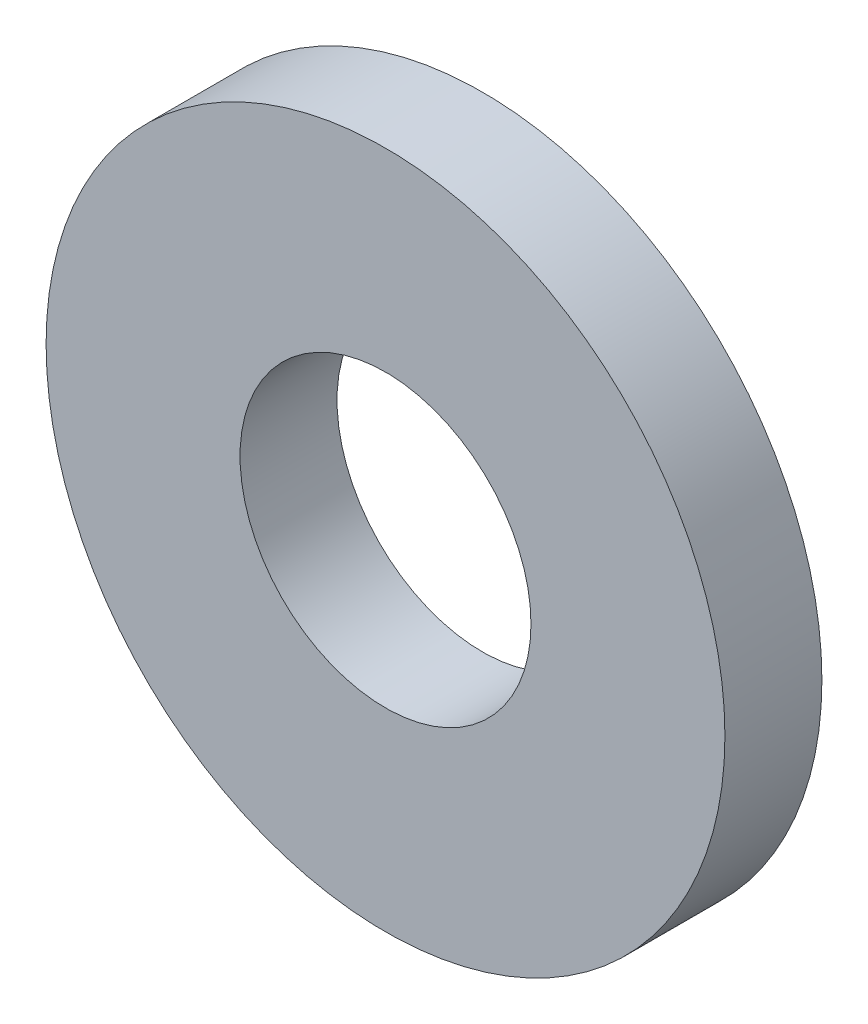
ISO-10303-21;
HEADER;
FILE_DESCRIPTION(('STEP AP214'),'2;1');
FILE_NAME('part.step','',(''),(''),'','','');
FILE_SCHEMA(('AUTOMOTIVE_DESIGN { 1 0 10303 214 1 1 1 1 }'));
ENDSEC;
DATA;
#1=APPLICATION_CONTEXT('core data for automotive mechanical design processes');
#2=APPLICATION_PROTOCOL_DEFINITION('international standard','automotive_design',2000,#1);
#3=PRODUCT_CONTEXT('',#1,'mechanical');
#4=PRODUCT('Part','Part','',(#3));
#5=PRODUCT_RELATED_PRODUCT_CATEGORY('part','',(#4));
#6=PRODUCT_DEFINITION_FORMATION('','',#4);
#7=PRODUCT_DEFINITION_CONTEXT('part definition',#1,'design');
#8=PRODUCT_DEFINITION('design','',#6,#7);
#9=PRODUCT_DEFINITION_SHAPE('','',#8);
#10=(LENGTH_UNIT() NAMED_UNIT(*) SI_UNIT(.MILLI.,.METRE.));
#11=(NAMED_UNIT(*) PLANE_ANGLE_UNIT() SI_UNIT($,.RADIAN.));
#12=(NAMED_UNIT(*) SI_UNIT($,.STERADIAN.) SOLID_ANGLE_UNIT());
#13=UNCERTAINTY_MEASURE_WITH_UNIT(LENGTH_MEASURE(1.E-05),#10,'distance_accuracy_value','');
#14=(GEOMETRIC_REPRESENTATION_CONTEXT(3) GLOBAL_UNCERTAINTY_ASSIGNED_CONTEXT((#13)) GLOBAL_UNIT_ASSIGNED_CONTEXT((#10,
#11,#12)) REPRESENTATION_CONTEXT('',''));
#15=CARTESIAN_POINT('',(0.,0.,0.));
#16=DIRECTION('',(0.,0.,1.));
#17=DIRECTION('',(1.,0.,0.));
#18=AXIS2_PLACEMENT_3D('',#15,#16,#17);
#19=CARTESIAN_POINT('',(11.35,-4.,0.5));
#20=DIRECTION('',(0.,0.,1.));
#21=DIRECTION('',(1.,0.,0.));
#22=AXIS2_PLACEMENT_3D('',#19,#20,#21);
#23=PLANE('',#22);
#24=CARTESIAN_POINT('',(11.35,-4.,0.5));
#25=DIRECTION('',(0.,0.,1.));
#26=DIRECTION('',(1.,0.,0.));
#27=AXIS2_PLACEMENT_3D('',#24,#25,#26);
#28=CIRCLE('',#27,1.75);
#29=CARTESIAN_POINT('',(13.1,-4.,0.5));
#30=VERTEX_POINT('',#29);
#31=EDGE_CURVE('E10',#30,#30,#28,.T.);
#32=ORIENTED_EDGE('',*,*,#31,.T.);
#33=EDGE_LOOP('',(#32));
#34=FACE_BOUND('',#33,.T.);
#35=CARTESIAN_POINT('',(11.35,-4.,0.5));
#36=DIRECTION('',(0.,0.,1.));
#37=DIRECTION('',(1.,0.,0.));
#38=AXIS2_PLACEMENT_3D('',#35,#36,#37);
#39=CIRCLE('',#38,0.749999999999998);
#40=CARTESIAN_POINT('',(12.1,-4.,0.5));
#41=VERTEX_POINT('',#40);
#42=EDGE_CURVE('E42',#41,#41,#39,.T.);
#43=ORIENTED_EDGE('',*,*,#42,.F.);
#44=EDGE_LOOP('',(#43));
#45=FACE_BOUND('',#44,.T.);
#46=ADVANCED_FACE('F31',(#34,#45),#23,.T.);
#47=CARTESIAN_POINT('',(11.35,-4.,0.));
#48=DIRECTION('',(0.,0.,1.));
#49=DIRECTION('',(1.,0.,0.));
#50=AXIS2_PLACEMENT_3D('',#47,#48,#49);
#51=PLANE('',#50);
#52=CARTESIAN_POINT('',(11.35,-4.,0.));
#53=DIRECTION('',(0.,0.,1.));
#54=DIRECTION('',(1.,0.,0.));
#55=AXIS2_PLACEMENT_3D('',#52,#53,#54);
#56=CIRCLE('',#55,1.75);
#57=CARTESIAN_POINT('',(13.1,-4.,0.));
#58=VERTEX_POINT('',#57);
#59=EDGE_CURVE('E38',#58,#58,#56,.T.);
#60=ORIENTED_EDGE('',*,*,#59,.F.);
#61=EDGE_LOOP('',(#60));
#62=FACE_BOUND('',#61,.T.);
#63=CARTESIAN_POINT('',(11.35,-4.,0.));
#64=DIRECTION('',(0.,0.,1.));
#65=DIRECTION('',(1.,0.,0.));
#66=AXIS2_PLACEMENT_3D('',#63,#64,#65);
#67=CIRCLE('',#66,0.749999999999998);
#68=CARTESIAN_POINT('',(12.1,-4.,0.));
#69=VERTEX_POINT('',#68);
#70=EDGE_CURVE('E46',#69,#69,#67,.T.);
#71=ORIENTED_EDGE('',*,*,#70,.T.);
#72=EDGE_LOOP('',(#71));
#73=FACE_BOUND('',#72,.T.);
#74=ADVANCED_FACE('F52',(#62,#73),#51,.F.);
#75=CARTESIAN_POINT('',(11.35,-4.,0.5));
#76=DIRECTION('',(0.,0.,-1.));
#77=DIRECTION('',(-1.,0.,0.));
#78=AXIS2_PLACEMENT_3D('',#75,#76,#77);
#79=CYLINDRICAL_SURFACE('',#78,1.75);
#80=ORIENTED_EDGE('',*,*,#31,.F.);
#81=EDGE_LOOP('',(#80));
#82=FACE_BOUND('',#81,.T.);
#83=ORIENTED_EDGE('',*,*,#59,.T.);
#84=EDGE_LOOP('',(#83));
#85=FACE_BOUND('',#84,.T.);
#86=ADVANCED_FACE('F33',(#82,#85),#79,.T.);
#87=CARTESIAN_POINT('',(11.35,-4.,0.5));
#88=DIRECTION('',(0.,0.,-1.));
#89=DIRECTION('',(-1.,0.,0.));
#90=AXIS2_PLACEMENT_3D('',#87,#88,#89);
#91=CYLINDRICAL_SURFACE('',#90,0.749999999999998);
#92=ORIENTED_EDGE('',*,*,#42,.T.);
#93=EDGE_LOOP('',(#92));
#94=FACE_BOUND('',#93,.T.);
#95=ORIENTED_EDGE('',*,*,#70,.F.);
#96=EDGE_LOOP('',(#95));
#97=FACE_BOUND('',#96,.T.);
#98=ADVANCED_FACE('F54',(#94,#97),#91,.F.);
#99=CLOSED_SHELL('',(#46,#74,#86,#98));
#100=MANIFOLD_SOLID_BREP('B2',#99);
#101=ADVANCED_BREP_SHAPE_REPRESENTATION('',(#18,#100),#14);
#102=SHAPE_DEFINITION_REPRESENTATION(#9,#101);
ENDSEC;
END-ISO-10303-21;
